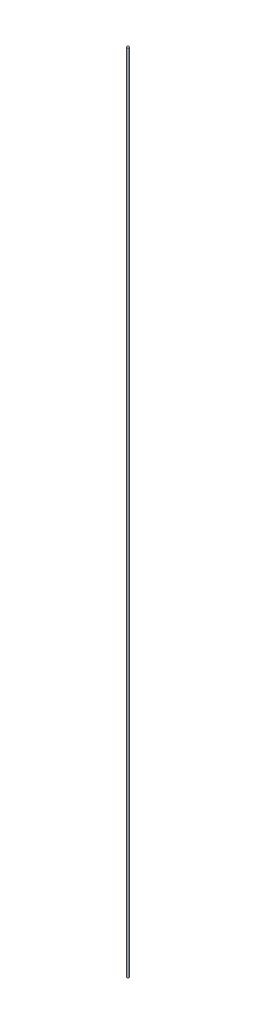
ISO-10303-21;
HEADER;
FILE_DESCRIPTION(('STEP AP214'),'2;1');
FILE_NAME('part.step','',(''),(''),'','','');
FILE_SCHEMA(('AUTOMOTIVE_DESIGN { 1 0 10303 214 1 1 1 1 }'));
ENDSEC;
DATA;
#1=APPLICATION_CONTEXT('core data for automotive mechanical design processes');
#2=APPLICATION_PROTOCOL_DEFINITION('international standard','automotive_design',2000,#1);
#3=PRODUCT_CONTEXT('',#1,'mechanical');
#4=PRODUCT('Part','Part','',(#3));
#5=PRODUCT_RELATED_PRODUCT_CATEGORY('part','',(#4));
#6=PRODUCT_DEFINITION_FORMATION('','',#4);
#7=PRODUCT_DEFINITION_CONTEXT('part definition',#1,'design');
#8=PRODUCT_DEFINITION('design','',#6,#7);
#9=PRODUCT_DEFINITION_SHAPE('','',#8);
#10=(LENGTH_UNIT() NAMED_UNIT(*) SI_UNIT(.MILLI.,.METRE.));
#11=(NAMED_UNIT(*) PLANE_ANGLE_UNIT() SI_UNIT($,.RADIAN.));
#12=(NAMED_UNIT(*) SI_UNIT($,.STERADIAN.) SOLID_ANGLE_UNIT());
#13=UNCERTAINTY_MEASURE_WITH_UNIT(LENGTH_MEASURE(1.E-05),#10,'distance_accuracy_value','');
#14=(GEOMETRIC_REPRESENTATION_CONTEXT(3) GLOBAL_UNCERTAINTY_ASSIGNED_CONTEXT((#13)) GLOBAL_UNIT_ASSIGNED_CONTEXT((#10,
#11,#12)) REPRESENTATION_CONTEXT('',''));
#15=CARTESIAN_POINT('',(0.,0.,0.));
#16=DIRECTION('',(0.,0.,1.));
#17=DIRECTION('',(1.,0.,0.));
#18=AXIS2_PLACEMENT_3D('',#15,#16,#17);
#19=CARTESIAN_POINT('',(13.,5.E-05,15.));
#20=DIRECTION('',(0.,-1.,0.));
#21=DIRECTION('',(0.,0.,-1.));
#22=AXIS2_PLACEMENT_3D('',#19,#20,#21);
#23=PLANE('',#22);
#24=CARTESIAN_POINT('',(13.,4.99999999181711E-05,15.));
#25=DIRECTION('',(0.,1.,0.));
#26=DIRECTION('',(0.,0.,1.));
#27=AXIS2_PLACEMENT_3D('',#24,#25,#26);
#28=CIRCLE('',#27,3.);
#29=CARTESIAN_POINT('',(13.,4.99999999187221E-05,18.));
#30=VERTEX_POINT('',#29);
#31=EDGE_CURVE('E17',#30,#30,#28,.T.);
#32=ORIENTED_EDGE('',*,*,#31,.F.);
#33=EDGE_LOOP('',(#32));
#34=FACE_BOUND('',#33,.T.);
#35=ADVANCED_FACE('F14',(#34),#23,.T.);
#36=CARTESIAN_POINT('',(13.,2099.99995,14.9999999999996));
#37=DIRECTION('',(0.,1.,0.));
#38=DIRECTION('',(0.,0.,1.));
#39=AXIS2_PLACEMENT_3D('',#36,#37,#38);
#40=PLANE('',#39);
#41=CARTESIAN_POINT('',(13.,2099.99995,14.9999999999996));
#42=DIRECTION('',(0.,1.,0.));
#43=DIRECTION('',(0.,0.,1.));
#44=AXIS2_PLACEMENT_3D('',#41,#42,#43);
#45=CIRCLE('',#44,3.);
#46=CARTESIAN_POINT('',(13.,2099.99995,17.9999999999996));
#47=VERTEX_POINT('',#46);
#48=EDGE_CURVE('E10',#47,#47,#45,.F.);
#49=ORIENTED_EDGE('',*,*,#48,.F.);
#50=EDGE_LOOP('',(#49));
#51=FACE_BOUND('',#50,.T.);
#52=ADVANCED_FACE('F29',(#51),#40,.T.);
#53=CARTESIAN_POINT('',(13.,1050.,14.9999999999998));
#54=DIRECTION('',(0.,1.,0.));
#55=DIRECTION('',(0.,0.,1.));
#56=AXIS2_PLACEMENT_3D('',#53,#54,#55);
#57=CYLINDRICAL_SURFACE('',#56,3.);
#58=ORIENTED_EDGE('',*,*,#31,.T.);
#59=EDGE_LOOP('',(#58));
#60=FACE_BOUND('',#59,.T.);
#61=ORIENTED_EDGE('',*,*,#48,.T.);
#62=EDGE_LOOP('',(#61));
#63=FACE_BOUND('',#62,.T.);
#64=ADVANCED_FACE('F26',(#60,#63),#57,.T.);
#65=CLOSED_SHELL('',(#35,#52,#64));
#66=MANIFOLD_SOLID_BREP('B1',#65);
#67=ADVANCED_BREP_SHAPE_REPRESENTATION('',(#18,#66),#14);
#68=SHAPE_DEFINITION_REPRESENTATION(#9,#67);
ENDSEC;
END-ISO-10303-21;
